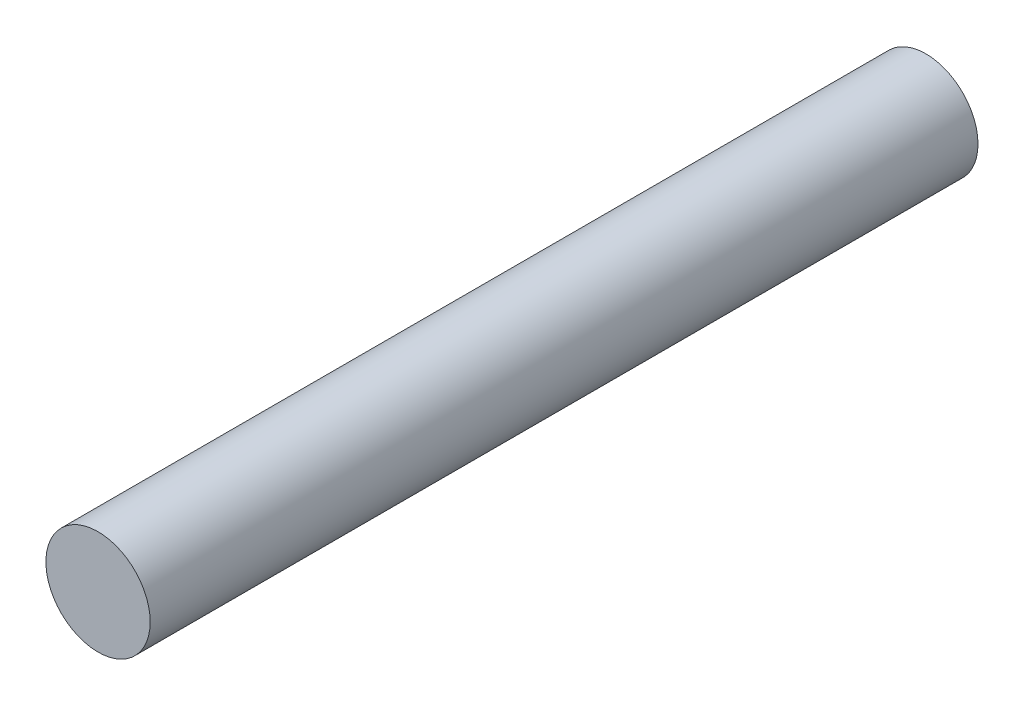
ISO-10303-21;
HEADER;
FILE_DESCRIPTION(('STEP AP214'),'2;1');
FILE_NAME('part.step','',(''),(''),'','','');
FILE_SCHEMA(('AUTOMOTIVE_DESIGN { 1 0 10303 214 1 1 1 1 }'));
ENDSEC;
DATA;
#1=APPLICATION_CONTEXT('core data for automotive mechanical design processes');
#2=APPLICATION_PROTOCOL_DEFINITION('international standard','automotive_design',2000,#1);
#3=PRODUCT_CONTEXT('',#1,'mechanical');
#4=PRODUCT('Part','Part','',(#3));
#5=PRODUCT_RELATED_PRODUCT_CATEGORY('part','',(#4));
#6=PRODUCT_DEFINITION_FORMATION('','',#4);
#7=PRODUCT_DEFINITION_CONTEXT('part definition',#1,'design');
#8=PRODUCT_DEFINITION('design','',#6,#7);
#9=PRODUCT_DEFINITION_SHAPE('','',#8);
#10=(LENGTH_UNIT() NAMED_UNIT(*) SI_UNIT(.MILLI.,.METRE.));
#11=(NAMED_UNIT(*) PLANE_ANGLE_UNIT() SI_UNIT($,.RADIAN.));
#12=(NAMED_UNIT(*) SI_UNIT($,.STERADIAN.) SOLID_ANGLE_UNIT());
#13=UNCERTAINTY_MEASURE_WITH_UNIT(LENGTH_MEASURE(1.E-05),#10,'distance_accuracy_value','');
#14=(GEOMETRIC_REPRESENTATION_CONTEXT(3) GLOBAL_UNCERTAINTY_ASSIGNED_CONTEXT((#13)) GLOBAL_UNIT_ASSIGNED_CONTEXT((#10,
#11,#12)) REPRESENTATION_CONTEXT('',''));
#15=CARTESIAN_POINT('',(0.,0.,0.));
#16=DIRECTION('',(0.,0.,1.));
#17=DIRECTION('',(1.,0.,0.));
#18=AXIS2_PLACEMENT_3D('',#15,#16,#17);
#19=CARTESIAN_POINT('',(0.,0.,101.6));
#20=DIRECTION('',(0.,0.,-1.));
#21=DIRECTION('',(-1.,0.,0.));
#22=AXIS2_PLACEMENT_3D('',#19,#20,#21);
#23=CYLINDRICAL_SURFACE('',#22,6.4);
#24=CARTESIAN_POINT('',(0.,0.,101.6));
#25=DIRECTION('',(0.,0.,1.));
#26=DIRECTION('',(1.,0.,0.));
#27=AXIS2_PLACEMENT_3D('',#24,#25,#26);
#28=CIRCLE('',#27,6.4);
#29=CARTESIAN_POINT('',(6.4,0.,101.6));
#30=VERTEX_POINT('',#29);
#31=EDGE_CURVE('E10',#30,#30,#28,.T.);
#32=ORIENTED_EDGE('',*,*,#31,.F.);
#33=EDGE_LOOP('',(#32));
#34=FACE_BOUND('',#33,.T.);
#35=CARTESIAN_POINT('',(0.,0.,0.));
#36=DIRECTION('',(0.,0.,1.));
#37=DIRECTION('',(1.,0.,0.));
#38=AXIS2_PLACEMENT_3D('',#35,#36,#37);
#39=CIRCLE('',#38,6.4);
#40=CARTESIAN_POINT('',(6.4,0.,0.));
#41=VERTEX_POINT('',#40);
#42=EDGE_CURVE('E35',#41,#41,#39,.T.);
#43=ORIENTED_EDGE('',*,*,#42,.T.);
#44=EDGE_LOOP('',(#43));
#45=FACE_BOUND('',#44,.T.);
#46=ADVANCED_FACE('F32',(#34,#45),#23,.T.);
#47=CARTESIAN_POINT('',(0.,0.,101.6));
#48=DIRECTION('',(0.,0.,1.));
#49=DIRECTION('',(1.,0.,0.));
#50=AXIS2_PLACEMENT_3D('',#47,#48,#49);
#51=PLANE('',#50);
#52=ORIENTED_EDGE('',*,*,#31,.T.);
#53=EDGE_LOOP('',(#52));
#54=FACE_BOUND('',#53,.T.);
#55=ADVANCED_FACE('F47',(#54),#51,.T.);
#56=CARTESIAN_POINT('',(0.,0.,0.));
#57=DIRECTION('',(0.,0.,1.));
#58=DIRECTION('',(1.,0.,0.));
#59=AXIS2_PLACEMENT_3D('',#56,#57,#58);
#60=PLANE('',#59);
#61=ORIENTED_EDGE('',*,*,#42,.F.);
#62=EDGE_LOOP('',(#61));
#63=FACE_BOUND('',#62,.T.);
#64=ADVANCED_FACE('F45',(#63),#60,.F.);
#65=CLOSED_SHELL('',(#46,#55,#64));
#66=MANIFOLD_SOLID_BREP('B2',#65);
#67=ADVANCED_BREP_SHAPE_REPRESENTATION('',(#18,#66),#14);
#68=SHAPE_DEFINITION_REPRESENTATION(#9,#67);
ENDSEC;
END-ISO-10303-21;
